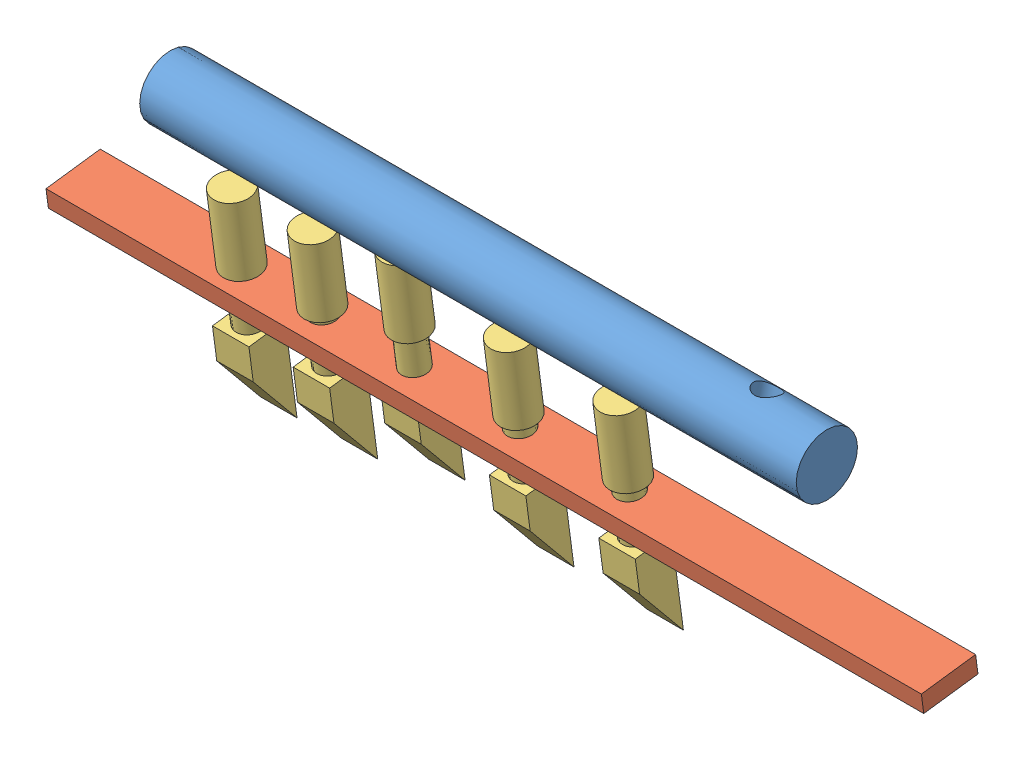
SolidWorks assembly Flute_Valve Component.SLDASM, configuration Default (file format 4400). Lengths in mm.
Overall size (304.8 109.69 29.96).
7 component instances, 3 part files, 12 mates.
Components (placement in the parent):
- Flute-1: Flute.SLDPRT [Default] at (-102.6408 52.8394 18.2638) size (228.6 21.34 21.34)
- ValveHolder-1: ValveHolder.SLDPRT [Default] at (-38.6909 17.6345 58.9711) x (1 0 0) z (0 -0.131181 0.991358) size (304.8 6.35 19.05)
- Valve-1: Valve.SLDPRT [Default] at (11.9269 11.4748 41.6246) x (1 0 0) z (0 0.131181 -0.991358) size (12.7 76.2 12.7)
- Valve-2: Valve.SLDPRT [Default] at (-24.9031 19.7844 42.7241) x (1 0 0) z (0 0.131181 -0.991358) size (12.7 76.2 12.7)
- Valve-3: Valve.SLDPRT [Default] at (50.0269 11.4748 41.6246) x (1 0 0) z (0 0.131181 -0.991358) size (12.7 76.2 12.7)
- Valve-4: Valve.SLDPRT [Default] at (-85.0007 7.7129 41.1268) x (1 0 0) z (0 0.131181 -0.991358) size (12.7 76.2 12.7)
- Valve-5: Valve.SLDPRT [Default] at (-56.6531 9.5718 41.3728) x (1 0 0) z (0 0.131181 -0.991358) size (12.7 76.2 12.7)
Mates (geometry in assembly coordinates):
- Concentric1: concentric aligned: cylinder of Flute-1 through (50.8709 63.8509 48.5505) axis (0 -0.991358 -0.131181) radius 4.2333; cylinder of ValveHolder-1 through (50.8709 26.0801 43.5525) axis (0 -0.991358 -0.131181) radius 4.445
- Distance3: distance = 38.1 mm anti-aligned: plane of ValveHolder-1 through (161.9124 24.8306 52.9952) normal (0 0.991358 0.131181); cylinder of Flute-1 through (125.9592 74.4267 49.95) axis (-1 0 0) radius 10.668
- Parallel1: parallel aligned: plane of ValveHolder-1 through (-142.8876 27.3296 34.1098) normal (0 0.131181 -0.991358); plane of Valve-4 through (-90.5067 -22.9291 30.662) normal (0 0.131181 -0.991358)
- Coincident4: coincident aligned: circle of ValveHolder-1; cylinder of Valve-5 through (-55.8091 28.4578 43.8671) axis (0 -0.991358 -0.131181) radius 4.445
- Parallel2: parallel aligned: plane of ValveHolder-1 through (-142.8876 27.3296 34.1098) normal (0 0.131181 -0.991358); plane of Valve-5 through (-62.1591 -21.0702 30.908) normal (0 0.131181 -0.991358)
- Concentric3: concentric aligned: cylinder of ValveHolder-1 through (-24.0591 26.0801 43.5525) axis (0 -0.991358 -0.131181) radius 4.445; cylinder of Valve-2 through (-24.0591 38.6704 45.2185) axis (0 -0.991358 -0.131181) radius 4.445
- Parallel4: parallel aligned: plane of ValveHolder-1 through (-142.8876 27.3296 34.1098) normal (0 0.131181 -0.991358); plane of Valve-2 through (-30.4091 -10.8576 32.2594) normal (0 0.131181 -0.991358)
- Coincident10: coincident anti-aligned: plane of ValveHolder-1 through (161.9124 18.5355 52.1622) normal (0 -0.991358 -0.131181); plane of Valve-2 through (-17.7091 20.618 36.4244) normal (0 0.991358 0.131181)
- Concentric4: concentric aligned: cylinder of ValveHolder-1 through (50.8709 26.0801 43.5525) axis (0 -0.991358 -0.131181) radius 4.445; cylinder of Valve-3 through (50.8709 30.3608 44.119) axis (0 -0.991358 -0.131181) radius 4.445
- Parallel5: parallel aligned: plane of ValveHolder-1 through (-142.8876 27.3296 34.1098) normal (0 0.131181 -0.991358); plane of Valve-3 through (44.5209 -19.1672 31.1598) normal (0 0.131181 -0.991358)
- Concentric5: concentric aligned: cylinder of ValveHolder-1 through (12.7709 26.0801 43.5525) axis (0 -0.991358 -0.131181) radius 4.445; cylinder of Valve-1 through (12.7709 30.3608 44.119) axis (0 -0.991358 -0.131181) radius 4.445
- Parallel6: parallel aligned: plane of ValveHolder-1 through (-142.8876 27.3296 34.1098) normal (0 0.131181 -0.991358); plane of Valve-1 through (6.4209 -19.1672 31.1598) normal (0 0.131181 -0.991358)
